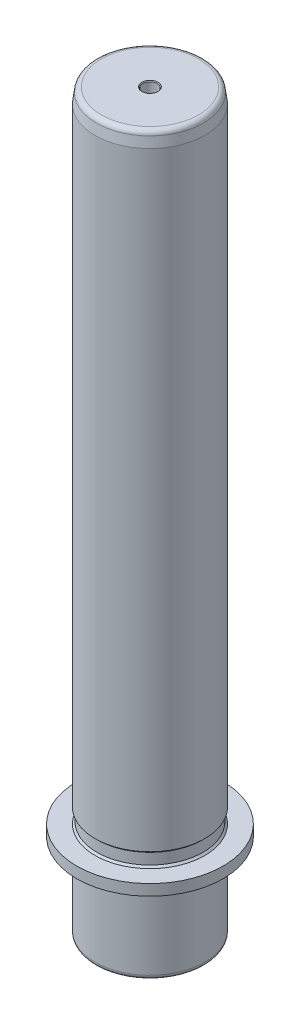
ISO-10303-21;
HEADER;
FILE_DESCRIPTION(('STEP AP214'),'2;1');
FILE_NAME('part.step','',(''),(''),'','','');
FILE_SCHEMA(('AUTOMOTIVE_DESIGN { 1 0 10303 214 1 1 1 1 }'));
ENDSEC;
DATA;
#1=APPLICATION_CONTEXT('core data for automotive mechanical design processes');
#2=APPLICATION_PROTOCOL_DEFINITION('international standard','automotive_design',2000,#1);
#3=PRODUCT_CONTEXT('',#1,'mechanical');
#4=PRODUCT('Part','Part','',(#3));
#5=PRODUCT_RELATED_PRODUCT_CATEGORY('part','',(#4));
#6=PRODUCT_DEFINITION_FORMATION('','',#4);
#7=PRODUCT_DEFINITION_CONTEXT('part definition',#1,'design');
#8=PRODUCT_DEFINITION('design','',#6,#7);
#9=PRODUCT_DEFINITION_SHAPE('','',#8);
#10=(LENGTH_UNIT() NAMED_UNIT(*) SI_UNIT(.MILLI.,.METRE.));
#11=(NAMED_UNIT(*) PLANE_ANGLE_UNIT() SI_UNIT($,.RADIAN.));
#12=(NAMED_UNIT(*) SI_UNIT($,.STERADIAN.) SOLID_ANGLE_UNIT());
#13=UNCERTAINTY_MEASURE_WITH_UNIT(LENGTH_MEASURE(1.E-05),#10,'distance_accuracy_value','');
#14=(GEOMETRIC_REPRESENTATION_CONTEXT(3) GLOBAL_UNCERTAINTY_ASSIGNED_CONTEXT((#13)) GLOBAL_UNIT_ASSIGNED_CONTEXT((#10,
#11,#12)) REPRESENTATION_CONTEXT('',''));
#15=CARTESIAN_POINT('',(0.,0.,0.));
#16=DIRECTION('',(0.,0.,1.));
#17=DIRECTION('',(1.,0.,0.));
#18=AXIS2_PLACEMENT_3D('',#15,#16,#17);
#19=CARTESIAN_POINT('',(0.,46.,0.));
#20=DIRECTION('',(0.,-1.,0.));
#21=DIRECTION('',(0.,0.,-1.));
#22=AXIS2_PLACEMENT_3D('',#19,#20,#21);
#23=CYLINDRICAL_SURFACE('',#22,30.);
#24=CARTESIAN_POINT('',(0.,2.5,0.));
#25=DIRECTION('',(0.,1.,0.));
#26=DIRECTION('',(0.,0.,1.));
#27=AXIS2_PLACEMENT_3D('',#24,#25,#26);
#28=CIRCLE('',#27,30.);
#29=CARTESIAN_POINT('',(0.,2.5,30.));
#30=VERTEX_POINT('',#29);
#31=EDGE_CURVE('E88',#30,#30,#28,.T.);
#32=ORIENTED_EDGE('',*,*,#31,.T.);
#33=EDGE_LOOP('',(#32));
#34=FACE_BOUND('',#33,.T.);
#35=CARTESIAN_POINT('',(0.,46.,0.));
#36=DIRECTION('',(0.,1.,0.));
#37=DIRECTION('',(0.,0.,1.));
#38=AXIS2_PLACEMENT_3D('',#35,#36,#37);
#39=CIRCLE('',#38,30.);
#40=CARTESIAN_POINT('',(0.,46.,30.));
#41=VERTEX_POINT('',#40);
#42=EDGE_CURVE('E84',#41,#41,#39,.T.);
#43=ORIENTED_EDGE('',*,*,#42,.F.);
#44=EDGE_LOOP('',(#43));
#45=FACE_BOUND('',#44,.T.);
#46=ADVANCED_FACE('F15',(#34,#45),#23,.T.);
#47=CARTESIAN_POINT('',(0.,46.,0.));
#48=DIRECTION('',(0.,1.,0.));
#49=DIRECTION('',(0.,0.,1.));
#50=AXIS2_PLACEMENT_3D('',#47,#48,#49);
#51=PLANE('',#50);
#52=CARTESIAN_POINT('',(0.,46.,0.));
#53=DIRECTION('',(0.,1.,0.));
#54=DIRECTION('',(0.,0.,1.));
#55=AXIS2_PLACEMENT_3D('',#52,#53,#54);
#56=CIRCLE('',#55,29.);
#57=CARTESIAN_POINT('',(0.,46.,29.));
#58=VERTEX_POINT('',#57);
#59=EDGE_CURVE('E85',#58,#58,#56,.T.);
#60=ORIENTED_EDGE('',*,*,#59,.F.);
#61=EDGE_LOOP('',(#60));
#62=FACE_BOUND('',#61,.T.);
#63=ORIENTED_EDGE('',*,*,#42,.T.);
#64=EDGE_LOOP('',(#63));
#65=FACE_BOUND('',#64,.T.);
#66=ADVANCED_FACE('F118',(#62,#65),#51,.T.);
#67=CARTESIAN_POINT('',(0.,0.,0.));
#68=DIRECTION('',(0.,1.,0.));
#69=DIRECTION('',(0.,0.,1.));
#70=AXIS2_PLACEMENT_3D('',#67,#68,#69);
#71=PLANE('',#70);
#72=CARTESIAN_POINT('',(0.,0.,0.));
#73=DIRECTION('',(0.,1.,0.));
#74=DIRECTION('',(0.,0.,1.));
#75=AXIS2_PLACEMENT_3D('',#72,#73,#74);
#76=CIRCLE('',#75,4.40000000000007);
#77=CARTESIAN_POINT('',(0.,0.,4.40000000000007));
#78=VERTEX_POINT('',#77);
#79=EDGE_CURVE('E23',#78,#78,#76,.T.);
#80=ORIENTED_EDGE('',*,*,#79,.T.);
#81=EDGE_LOOP('',(#80));
#82=FACE_BOUND('',#81,.T.);
#83=CARTESIAN_POINT('',(0.,0.,0.));
#84=DIRECTION('',(0.,1.,0.));
#85=DIRECTION('',(0.,0.,1.));
#86=AXIS2_PLACEMENT_3D('',#83,#84,#85);
#87=CIRCLE('',#86,27.5);
#88=CARTESIAN_POINT('',(0.,0.,27.5));
#89=VERTEX_POINT('',#88);
#90=EDGE_CURVE('E93',#89,#89,#87,.F.);
#91=ORIENTED_EDGE('',*,*,#90,.T.);
#92=EDGE_LOOP('',(#91));
#93=FACE_BOUND('',#92,.T.);
#94=ADVANCED_FACE('F105',(#82,#93),#71,.F.);
#95=CARTESIAN_POINT('',(0.,47.,0.));
#96=DIRECTION('',(0.,-1.,0.));
#97=DIRECTION('',(0.,0.,-1.));
#98=AXIS2_PLACEMENT_3D('',#95,#96,#97);
#99=CYLINDRICAL_SURFACE('',#98,29.);
#100=CARTESIAN_POINT('',(0.,47.,0.));
#101=DIRECTION('',(0.,1.,0.));
#102=DIRECTION('',(0.,0.,1.));
#103=AXIS2_PLACEMENT_3D('',#100,#101,#102);
#104=CIRCLE('',#103,29.);
#105=CARTESIAN_POINT('',(0.,47.,29.));
#106=VERTEX_POINT('',#105);
#107=EDGE_CURVE('E79',#106,#106,#104,.T.);
#108=ORIENTED_EDGE('',*,*,#107,.F.);
#109=EDGE_LOOP('',(#108));
#110=FACE_BOUND('',#109,.T.);
#111=ORIENTED_EDGE('',*,*,#59,.T.);
#112=EDGE_LOOP('',(#111));
#113=FACE_BOUND('',#112,.T.);
#114=ADVANCED_FACE('F177',(#110,#113),#99,.T.);
#115=CARTESIAN_POINT('',(0.,53.,0.));
#116=DIRECTION('',(0.,-1.,0.));
#117=DIRECTION('',(0.,0.,-1.));
#118=AXIS2_PLACEMENT_3D('',#115,#116,#117);
#119=CYLINDRICAL_SURFACE('',#118,40.);
#120=CARTESIAN_POINT('',(0.,53.,0.));
#121=DIRECTION('',(0.,1.,0.));
#122=DIRECTION('',(0.,0.,1.));
#123=AXIS2_PLACEMENT_3D('',#120,#121,#122);
#124=CIRCLE('',#123,40.);
#125=CARTESIAN_POINT('',(0.,53.,40.));
#126=VERTEX_POINT('',#125);
#127=EDGE_CURVE('E76',#126,#126,#124,.T.);
#128=ORIENTED_EDGE('',*,*,#127,.F.);
#129=EDGE_LOOP('',(#128));
#130=FACE_BOUND('',#129,.T.);
#131=CARTESIAN_POINT('',(0.,47.,0.));
#132=DIRECTION('',(0.,1.,0.));
#133=DIRECTION('',(0.,0.,1.));
#134=AXIS2_PLACEMENT_3D('',#131,#132,#133);
#135=CIRCLE('',#134,40.);
#136=CARTESIAN_POINT('',(0.,47.,40.));
#137=VERTEX_POINT('',#136);
#138=EDGE_CURVE('E75',#137,#137,#135,.T.);
#139=ORIENTED_EDGE('',*,*,#138,.T.);
#140=EDGE_LOOP('',(#139));
#141=FACE_BOUND('',#140,.T.);
#142=ADVANCED_FACE('F172',(#130,#141),#119,.T.);
#143=CARTESIAN_POINT('',(0.,53.,0.));
#144=DIRECTION('',(0.,1.,0.));
#145=DIRECTION('',(0.,0.,1.));
#146=AXIS2_PLACEMENT_3D('',#143,#144,#145);
#147=PLANE('',#146);
#148=CARTESIAN_POINT('',(0.,53.,0.));
#149=DIRECTION('',(0.,-1.,0.));
#150=DIRECTION('',(0.,0.,-1.));
#151=AXIS2_PLACEMENT_3D('',#148,#149,#150);
#152=CIRCLE('',#151,30.);
#153=CARTESIAN_POINT('',(0.,53.,-30.));
#154=VERTEX_POINT('',#153);
#155=EDGE_CURVE('E69',#154,#154,#152,.T.);
#156=ORIENTED_EDGE('',*,*,#155,.T.);
#157=EDGE_LOOP('',(#156));
#158=FACE_BOUND('',#157,.T.);
#159=ORIENTED_EDGE('',*,*,#127,.T.);
#160=EDGE_LOOP('',(#159));
#161=FACE_BOUND('',#160,.T.);
#162=ADVANCED_FACE('F165',(#158,#161),#147,.T.);
#163=CARTESIAN_POINT('',(0.,47.,0.));
#164=DIRECTION('',(0.,1.,0.));
#165=DIRECTION('',(0.,0.,1.));
#166=AXIS2_PLACEMENT_3D('',#163,#164,#165);
#167=PLANE('',#166);
#168=ORIENTED_EDGE('',*,*,#107,.T.);
#169=EDGE_LOOP('',(#168));
#170=FACE_BOUND('',#169,.T.);
#171=ORIENTED_EDGE('',*,*,#138,.F.);
#172=EDGE_LOOP('',(#171));
#173=FACE_BOUND('',#172,.T.);
#174=ADVANCED_FACE('F158',(#170,#173),#167,.F.);
#175=CARTESIAN_POINT('',(0.,399.32,0.));
#176=DIRECTION('',(0.,-1.,0.));
#177=DIRECTION('',(0.,0.,-1.));
#178=AXIS2_PLACEMENT_3D('',#175,#176,#177);
#179=TOROIDAL_SURFACE('',#178,26.5601349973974,2.68);
#180=CARTESIAN_POINT('',(0.,399.42,0.));
#181=DIRECTION('',(0.,-1.,0.));
#182=DIRECTION('',(0.,0.,-1.));
#183=AXIS2_PLACEMENT_3D('',#180,#181,#182);
#184=CIRCLE('',#183,29.238268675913);
#185=CARTESIAN_POINT('',(0.,399.42,-29.238268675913));
#186=VERTEX_POINT('',#185);
#187=EDGE_CURVE('E53',#186,#186,#184,.T.);
#188=ORIENTED_EDGE('',*,*,#187,.F.);
#189=EDGE_LOOP('',(#188));
#190=FACE_BOUND('',#189,.T.);
#191=CARTESIAN_POINT('',(0.,402.,0.));
#192=DIRECTION('',(0.,-1.,0.));
#193=DIRECTION('',(0.,0.,-1.));
#194=AXIS2_PLACEMENT_3D('',#191,#192,#193);
#195=CIRCLE('',#194,26.5601349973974);
#196=CARTESIAN_POINT('',(0.,402.,-26.5601349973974));
#197=VERTEX_POINT('',#196);
#198=EDGE_CURVE('E72',#197,#197,#195,.T.);
#199=ORIENTED_EDGE('',*,*,#198,.T.);
#200=EDGE_LOOP('',(#199));
#201=FACE_BOUND('',#200,.T.);
#202=ADVANCED_FACE('F153',(#190,#201),#179,.T.);
#203=CARTESIAN_POINT('',(0.,402.,0.));
#204=DIRECTION('',(0.,1.,0.));
#205=DIRECTION('',(0.,0.,1.));
#206=AXIS2_PLACEMENT_3D('',#203,#204,#205);
#207=PLANE('',#206);
#208=CARTESIAN_POINT('',(0.,402.,0.));
#209=DIRECTION('',(0.,1.,0.));
#210=DIRECTION('',(0.,0.,1.));
#211=AXIS2_PLACEMENT_3D('',#208,#209,#210);
#212=CIRCLE('',#211,4.4);
#213=CARTESIAN_POINT('',(0.,402.,4.4));
#214=VERTEX_POINT('',#213);
#215=EDGE_CURVE('E96',#214,#214,#212,.F.);
#216=ORIENTED_EDGE('',*,*,#215,.T.);
#217=EDGE_LOOP('',(#216));
#218=FACE_BOUND('',#217,.T.);
#219=ORIENTED_EDGE('',*,*,#198,.F.);
#220=EDGE_LOOP('',(#219));
#221=FACE_BOUND('',#220,.T.);
#222=ADVANCED_FACE('F149',(#218,#221),#207,.T.);
#223=CARTESIAN_POINT('',(0.,54.,0.));
#224=DIRECTION('',(0.,-1.,0.));
#225=DIRECTION('',(0.,0.,-1.));
#226=AXIS2_PLACEMENT_3D('',#223,#224,#225);
#227=CONICAL_SURFACE('',#226,29.,0.785398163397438);
#228=ORIENTED_EDGE('',*,*,#155,.F.);
#229=EDGE_LOOP('',(#228));
#230=FACE_BOUND('',#229,.T.);
#231=CARTESIAN_POINT('',(0.,54.,0.));
#232=DIRECTION('',(0.,-1.,0.));
#233=DIRECTION('',(0.,0.,-1.));
#234=AXIS2_PLACEMENT_3D('',#231,#232,#233);
#235=CIRCLE('',#234,29.);
#236=CARTESIAN_POINT('',(0.,54.,-29.));
#237=VERTEX_POINT('',#236);
#238=EDGE_CURVE('E66',#237,#237,#235,.T.);
#239=ORIENTED_EDGE('',*,*,#238,.T.);
#240=EDGE_LOOP('',(#239));
#241=FACE_BOUND('',#240,.T.);
#242=ADVANCED_FACE('F152',(#230,#241),#227,.T.);
#243=CARTESIAN_POINT('',(0.,53.,0.));
#244=DIRECTION('',(0.,-1.,0.));
#245=DIRECTION('',(0.,0.,-1.));
#246=AXIS2_PLACEMENT_3D('',#243,#244,#245);
#247=CYLINDRICAL_SURFACE('',#246,29.);
#248=CARTESIAN_POINT('',(0.,60.,0.));
#249=DIRECTION('',(0.,-1.,0.));
#250=DIRECTION('',(0.,0.,-1.));
#251=AXIS2_PLACEMENT_3D('',#248,#249,#250);
#252=CIRCLE('',#251,29.);
#253=CARTESIAN_POINT('',(0.,60.,-29.));
#254=VERTEX_POINT('',#253);
#255=EDGE_CURVE('E63',#254,#254,#252,.T.);
#256=ORIENTED_EDGE('',*,*,#255,.T.);
#257=EDGE_LOOP('',(#256));
#258=FACE_BOUND('',#257,.T.);
#259=ORIENTED_EDGE('',*,*,#238,.F.);
#260=EDGE_LOOP('',(#259));
#261=FACE_BOUND('',#260,.T.);
#262=ADVANCED_FACE('F270',(#258,#261),#247,.T.);
#263=CARTESIAN_POINT('',(0.,61.,0.));
#264=DIRECTION('',(0.,1.,0.));
#265=DIRECTION('',(0.,0.,1.));
#266=AXIS2_PLACEMENT_3D('',#263,#264,#265);
#267=CONICAL_SURFACE('',#266,30.,0.785398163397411);
#268=ORIENTED_EDGE('',*,*,#255,.F.);
#269=EDGE_LOOP('',(#268));
#270=FACE_BOUND('',#269,.T.);
#271=CARTESIAN_POINT('',(0.,61.,0.));
#272=DIRECTION('',(0.,-1.,0.));
#273=DIRECTION('',(0.,0.,-1.));
#274=AXIS2_PLACEMENT_3D('',#271,#272,#273);
#275=CIRCLE('',#274,30.);
#276=CARTESIAN_POINT('',(0.,61.,-30.));
#277=VERTEX_POINT('',#276);
#278=EDGE_CURVE('E60',#277,#277,#275,.T.);
#279=ORIENTED_EDGE('',*,*,#278,.T.);
#280=EDGE_LOOP('',(#279));
#281=FACE_BOUND('',#280,.T.);
#282=ADVANCED_FACE('F277',(#270,#281),#267,.T.);
#283=CARTESIAN_POINT('',(0.,53.,0.));
#284=DIRECTION('',(0.,-1.,0.));
#285=DIRECTION('',(0.,0.,-1.));
#286=AXIS2_PLACEMENT_3D('',#283,#284,#285);
#287=CYLINDRICAL_SURFACE('',#286,30.);
#288=CARTESIAN_POINT('',(0.,394.,0.));
#289=DIRECTION('',(0.,-1.,0.));
#290=DIRECTION('',(0.,0.,-1.));
#291=AXIS2_PLACEMENT_3D('',#288,#289,#290);
#292=CIRCLE('',#291,30.);
#293=CARTESIAN_POINT('',(0.,394.,-30.));
#294=VERTEX_POINT('',#293);
#295=EDGE_CURVE('E57',#294,#294,#292,.T.);
#296=ORIENTED_EDGE('',*,*,#295,.T.);
#297=EDGE_LOOP('',(#296));
#298=FACE_BOUND('',#297,.T.);
#299=ORIENTED_EDGE('',*,*,#278,.F.);
#300=EDGE_LOOP('',(#299));
#301=FACE_BOUND('',#300,.T.);
#302=ADVANCED_FACE('F286',(#298,#301),#287,.T.);
#303=CARTESIAN_POINT('',(0.,394.,0.));
#304=DIRECTION('',(0.,-1.,0.));
#305=DIRECTION('',(0.,0.,-1.));
#306=AXIS2_PLACEMENT_3D('',#303,#304,#305);
#307=CONICAL_SURFACE('',#306,30.,0.139626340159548);
#308=ORIENTED_EDGE('',*,*,#187,.T.);
#309=EDGE_LOOP('',(#308));
#310=FACE_BOUND('',#309,.T.);
#311=ORIENTED_EDGE('',*,*,#295,.F.);
#312=EDGE_LOOP('',(#311));
#313=FACE_BOUND('',#312,.T.);
#314=ADVANCED_FACE('F133',(#310,#313),#307,.T.);
#315=CARTESIAN_POINT('',(0.,2.5,0.));
#316=DIRECTION('',(0.,1.,0.));
#317=DIRECTION('',(0.,0.,1.));
#318=AXIS2_PLACEMENT_3D('',#315,#316,#317);
#319=TOROIDAL_SURFACE('',#318,27.5,2.5);
#320=ORIENTED_EDGE('',*,*,#90,.F.);
#321=EDGE_LOOP('',(#320));
#322=FACE_BOUND('',#321,.T.);
#323=ORIENTED_EDGE('',*,*,#31,.F.);
#324=EDGE_LOOP('',(#323));
#325=FACE_BOUND('',#324,.T.);
#326=ADVANCED_FACE('F130',(#322,#325),#319,.T.);
#327=CARTESIAN_POINT('',(0.,401.,0.));
#328=DIRECTION('',(0.,1.,0.));
#329=DIRECTION('',(0.,0.,1.));
#330=AXIS2_PLACEMENT_3D('',#327,#328,#329);
#331=CONICAL_SURFACE('',#330,3.4,0.785398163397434);
#332=CARTESIAN_POINT('',(0.,401.6,0.));
#333=DIRECTION('',(0.,1.,0.));
#334=DIRECTION('',(0.,0.,1.));
#335=AXIS2_PLACEMENT_3D('',#332,#333,#334);
#336=CIRCLE('',#335,4.);
#337=CARTESIAN_POINT('',(0.,401.6,4.));
#338=VERTEX_POINT('',#337);
#339=EDGE_CURVE('E43',#338,#338,#336,.T.);
#340=ORIENTED_EDGE('',*,*,#339,.F.);
#341=EDGE_LOOP('',(#340));
#342=FACE_BOUND('',#341,.T.);
#343=ORIENTED_EDGE('',*,*,#215,.F.);
#344=EDGE_LOOP('',(#343));
#345=FACE_BOUND('',#344,.T.);
#346=ADVANCED_FACE('F132',(#342,#345),#331,.F.);
#347=CARTESIAN_POINT('',(0.,392.,0.));
#348=DIRECTION('',(0.,1.,0.));
#349=DIRECTION('',(0.,0.,1.));
#350=AXIS2_PLACEMENT_3D('',#347,#348,#349);
#351=PLANE('',#350);
#352=CARTESIAN_POINT('',(0.,392.,0.));
#353=DIRECTION('',(0.,1.,0.));
#354=DIRECTION('',(0.,0.,1.));
#355=AXIS2_PLACEMENT_3D('',#352,#353,#354);
#356=CIRCLE('',#355,4.);
#357=CARTESIAN_POINT('',(0.,392.,4.));
#358=VERTEX_POINT('',#357);
#359=EDGE_CURVE('E39',#358,#358,#356,.T.);
#360=ORIENTED_EDGE('',*,*,#359,.T.);
#361=EDGE_LOOP('',(#360));
#362=FACE_BOUND('',#361,.T.);
#363=CARTESIAN_POINT('',(0.,392.,0.));
#364=DIRECTION('',(0.,1.,0.));
#365=DIRECTION('',(0.,0.,1.));
#366=AXIS2_PLACEMENT_3D('',#363,#364,#365);
#367=CIRCLE('',#366,3.4);
#368=CARTESIAN_POINT('',(0.,392.,3.4));
#369=VERTEX_POINT('',#368);
#370=EDGE_CURVE('E54',#369,#369,#367,.F.);
#371=ORIENTED_EDGE('',*,*,#370,.T.);
#372=EDGE_LOOP('',(#371));
#373=FACE_BOUND('',#372,.T.);
#374=ADVANCED_FACE('F136',(#362,#373),#351,.T.);
#375=CARTESIAN_POINT('',(0.,392.,0.));
#376=DIRECTION('',(0.,1.,0.));
#377=DIRECTION('',(0.,0.,1.));
#378=AXIS2_PLACEMENT_3D('',#375,#376,#377);
#379=CYLINDRICAL_SURFACE('',#378,4.);
#380=ORIENTED_EDGE('',*,*,#339,.T.);
#381=EDGE_LOOP('',(#380));
#382=FACE_BOUND('',#381,.T.);
#383=ORIENTED_EDGE('',*,*,#359,.F.);
#384=EDGE_LOOP('',(#383));
#385=FACE_BOUND('',#384,.T.);
#386=ADVANCED_FACE('F142',(#382,#385),#379,.F.);
#387=CARTESIAN_POINT('',(0.,386.,0.));
#388=DIRECTION('',(0.,1.,0.));
#389=DIRECTION('',(0.,0.,1.));
#390=AXIS2_PLACEMENT_3D('',#387,#388,#389);
#391=CONICAL_SURFACE('',#390,3.4,1.02974425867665);
#392=CARTESIAN_POINT('',(0.,383.957073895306,0.));
#393=VERTEX_POINT('',#392);
#394=VERTEX_LOOP('',#393);
#395=FACE_BOUND('',#394,.T.);
#396=CARTESIAN_POINT('',(0.,386.,0.));
#397=DIRECTION('',(0.,1.,0.));
#398=DIRECTION('',(0.,0.,1.));
#399=AXIS2_PLACEMENT_3D('',#396,#397,#398);
#400=CIRCLE('',#399,3.4);
#401=CARTESIAN_POINT('',(0.,386.,3.4));
#402=VERTEX_POINT('',#401);
#403=EDGE_CURVE('E50',#402,#402,#400,.T.);
#404=ORIENTED_EDGE('',*,*,#403,.T.);
#405=EDGE_LOOP('',(#404));
#406=FACE_BOUND('',#405,.T.);
#407=ADVANCED_FACE('F306',(#395,#406),#391,.F.);
#408=CARTESIAN_POINT('',(0.,402.,0.));
#409=DIRECTION('',(0.,1.,0.));
#410=DIRECTION('',(0.,0.,1.));
#411=AXIS2_PLACEMENT_3D('',#408,#409,#410);
#412=CYLINDRICAL_SURFACE('',#411,3.4);
#413=ORIENTED_EDGE('',*,*,#403,.F.);
#414=EDGE_LOOP('',(#413));
#415=FACE_BOUND('',#414,.T.);
#416=ORIENTED_EDGE('',*,*,#370,.F.);
#417=EDGE_LOOP('',(#416));
#418=FACE_BOUND('',#417,.T.);
#419=ADVANCED_FACE('F311',(#415,#418),#412,.F.);
#420=CARTESIAN_POINT('',(0.,10.,0.));
#421=DIRECTION('',(0.,-1.,0.));
#422=DIRECTION('',(0.,0.,1.));
#423=AXIS2_PLACEMENT_3D('',#420,#421,#422);
#424=PLANE('',#423);
#425=CARTESIAN_POINT('',(0.,10.,0.));
#426=DIRECTION('',(0.,1.,0.));
#427=DIRECTION('',(0.,0.,1.));
#428=AXIS2_PLACEMENT_3D('',#425,#426,#427);
#429=CIRCLE('',#428,4.);
#430=CARTESIAN_POINT('',(0.,10.,4.));
#431=VERTEX_POINT('',#430);
#432=EDGE_CURVE('E46',#431,#431,#429,.T.);
#433=ORIENTED_EDGE('',*,*,#432,.F.);
#434=EDGE_LOOP('',(#433));
#435=FACE_BOUND('',#434,.T.);
#436=CARTESIAN_POINT('',(0.,10.,0.));
#437=DIRECTION('',(0.,-1.,0.));
#438=DIRECTION('',(0.,0.,-1.));
#439=AXIS2_PLACEMENT_3D('',#436,#437,#438);
#440=CIRCLE('',#439,3.4);
#441=CARTESIAN_POINT('',(0.,10.,-3.4));
#442=VERTEX_POINT('',#441);
#443=EDGE_CURVE('E40',#442,#442,#440,.F.);
#444=ORIENTED_EDGE('',*,*,#443,.T.);
#445=EDGE_LOOP('',(#444));
#446=FACE_BOUND('',#445,.T.);
#447=ADVANCED_FACE('F327',(#435,#446),#424,.T.);
#448=CARTESIAN_POINT('',(0.,10.,0.));
#449=DIRECTION('',(0.,-1.,0.));
#450=DIRECTION('',(0.,0.,-1.));
#451=AXIS2_PLACEMENT_3D('',#448,#449,#450);
#452=CYLINDRICAL_SURFACE('',#451,4.);
#453=CARTESIAN_POINT('',(0.,0.40000000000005,0.));
#454=DIRECTION('',(0.,1.,0.));
#455=DIRECTION('',(0.,0.,1.));
#456=AXIS2_PLACEMENT_3D('',#453,#454,#455);
#457=CIRCLE('',#456,4.);
#458=CARTESIAN_POINT('',(0.,0.40000000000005,4.));
#459=VERTEX_POINT('',#458);
#460=EDGE_CURVE('E9',#459,#459,#457,.F.);
#461=ORIENTED_EDGE('',*,*,#460,.T.);
#462=EDGE_LOOP('',(#461));
#463=FACE_BOUND('',#462,.T.);
#464=ORIENTED_EDGE('',*,*,#432,.T.);
#465=EDGE_LOOP('',(#464));
#466=FACE_BOUND('',#465,.T.);
#467=ADVANCED_FACE('F33',(#463,#466),#452,.F.);
#468=CARTESIAN_POINT('',(0.,16.,0.));
#469=DIRECTION('',(0.,-1.,0.));
#470=DIRECTION('',(0.,0.,-1.));
#471=AXIS2_PLACEMENT_3D('',#468,#469,#470);
#472=CONICAL_SURFACE('',#471,3.4,1.02974425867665);
#473=CARTESIAN_POINT('',(0.,18.0429261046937,0.));
#474=VERTEX_POINT('',#473);
#475=VERTEX_LOOP('',#474);
#476=FACE_BOUND('',#475,.T.);
#477=CARTESIAN_POINT('',(0.,16.,0.));
#478=DIRECTION('',(0.,-1.,0.));
#479=DIRECTION('',(0.,0.,-1.));
#480=AXIS2_PLACEMENT_3D('',#477,#478,#479);
#481=CIRCLE('',#480,3.4);
#482=CARTESIAN_POINT('',(0.,16.,-3.4));
#483=VERTEX_POINT('',#482);
#484=EDGE_CURVE('E37',#483,#483,#481,.T.);
#485=ORIENTED_EDGE('',*,*,#484,.T.);
#486=EDGE_LOOP('',(#485));
#487=FACE_BOUND('',#486,.T.);
#488=ADVANCED_FACE('F29',(#476,#487),#472,.F.);
#489=CARTESIAN_POINT('',(0.,0.,0.));
#490=DIRECTION('',(0.,-1.,0.));
#491=DIRECTION('',(0.,0.,-1.));
#492=AXIS2_PLACEMENT_3D('',#489,#490,#491);
#493=CYLINDRICAL_SURFACE('',#492,3.4);
#494=ORIENTED_EDGE('',*,*,#484,.F.);
#495=EDGE_LOOP('',(#494));
#496=FACE_BOUND('',#495,.T.);
#497=ORIENTED_EDGE('',*,*,#443,.F.);
#498=EDGE_LOOP('',(#497));
#499=FACE_BOUND('',#498,.T.);
#500=ADVANCED_FACE('F32',(#496,#499),#493,.F.);
#501=CARTESIAN_POINT('',(0.,0.,0.));
#502=DIRECTION('',(0.,-1.,0.));
#503=DIRECTION('',(0.,0.,-1.));
#504=AXIS2_PLACEMENT_3D('',#501,#502,#503);
#505=CONICAL_SURFACE('',#504,4.40000000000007,0.785398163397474);
#506=ORIENTED_EDGE('',*,*,#460,.F.);
#507=EDGE_LOOP('',(#506));
#508=FACE_BOUND('',#507,.T.);
#509=ORIENTED_EDGE('',*,*,#79,.F.);
#510=EDGE_LOOP('',(#509));
#511=FACE_BOUND('',#510,.T.);
#512=ADVANCED_FACE('F17',(#508,#511),#505,.F.);
#513=CLOSED_SHELL('',(#46,#66,#94,#114,#142,#162,#174,#202,#222,#242,#262,#282,#302,#314,#326,
#346,#374,#386,#407,#419,#447,#467,#488,#500,#512));
#514=MANIFOLD_SOLID_BREP('B1',#513);
#515=ADVANCED_BREP_SHAPE_REPRESENTATION('',(#18,#514),#14);
#516=SHAPE_DEFINITION_REPRESENTATION(#9,#515);
ENDSEC;
END-ISO-10303-21;
